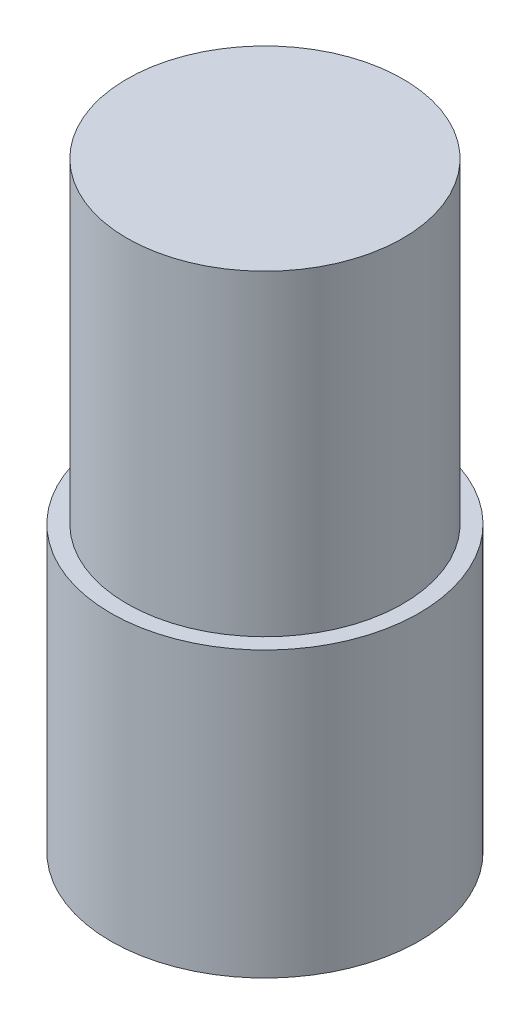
ISO-10303-21;
HEADER;
FILE_DESCRIPTION(('STEP AP214'),'2;1');
FILE_NAME('part.step','',(''),(''),'','','');
FILE_SCHEMA(('AUTOMOTIVE_DESIGN { 1 0 10303 214 1 1 1 1 }'));
ENDSEC;
DATA;
#1=APPLICATION_CONTEXT('core data for automotive mechanical design processes');
#2=APPLICATION_PROTOCOL_DEFINITION('international standard','automotive_design',2000,#1);
#3=PRODUCT_CONTEXT('',#1,'mechanical');
#4=PRODUCT('Part','Part','',(#3));
#5=PRODUCT_RELATED_PRODUCT_CATEGORY('part','',(#4));
#6=PRODUCT_DEFINITION_FORMATION('','',#4);
#7=PRODUCT_DEFINITION_CONTEXT('part definition',#1,'design');
#8=PRODUCT_DEFINITION('design','',#6,#7);
#9=PRODUCT_DEFINITION_SHAPE('','',#8);
#10=(LENGTH_UNIT() NAMED_UNIT(*) SI_UNIT(.MILLI.,.METRE.));
#11=(NAMED_UNIT(*) PLANE_ANGLE_UNIT() SI_UNIT($,.RADIAN.));
#12=(NAMED_UNIT(*) SI_UNIT($,.STERADIAN.) SOLID_ANGLE_UNIT());
#13=UNCERTAINTY_MEASURE_WITH_UNIT(LENGTH_MEASURE(1.E-05),#10,'distance_accuracy_value','');
#14=(GEOMETRIC_REPRESENTATION_CONTEXT(3) GLOBAL_UNCERTAINTY_ASSIGNED_CONTEXT((#13)) GLOBAL_UNIT_ASSIGNED_CONTEXT((#10,
#11,#12)) REPRESENTATION_CONTEXT('',''));
#15=CARTESIAN_POINT('',(0.,0.,0.));
#16=DIRECTION('',(0.,0.,1.));
#17=DIRECTION('',(1.,0.,0.));
#18=AXIS2_PLACEMENT_3D('',#15,#16,#17);
#19=CARTESIAN_POINT('',(0.,35.,0.));
#20=DIRECTION('',(0.,-1.,0.));
#21=DIRECTION('',(0.,0.,-1.));
#22=AXIS2_PLACEMENT_3D('',#19,#20,#21);
#23=CYLINDRICAL_SURFACE('',#22,19.);
#24=CARTESIAN_POINT('',(0.,35.,0.));
#25=DIRECTION('',(0.,1.,0.));
#26=DIRECTION('',(0.,0.,1.));
#27=AXIS2_PLACEMENT_3D('',#24,#25,#26);
#28=CIRCLE('',#27,19.);
#29=CARTESIAN_POINT('',(0.,35.,19.));
#30=VERTEX_POINT('',#29);
#31=EDGE_CURVE('E61',#30,#30,#28,.T.);
#32=ORIENTED_EDGE('',*,*,#31,.F.);
#33=EDGE_LOOP('',(#32));
#34=FACE_BOUND('',#33,.T.);
#35=CARTESIAN_POINT('',(0.,0.,0.));
#36=DIRECTION('',(0.,1.,0.));
#37=DIRECTION('',(0.,0.,1.));
#38=AXIS2_PLACEMENT_3D('',#35,#36,#37);
#39=CIRCLE('',#38,19.);
#40=CARTESIAN_POINT('',(0.,0.,19.));
#41=VERTEX_POINT('',#40);
#42=EDGE_CURVE('E58',#41,#41,#39,.T.);
#43=ORIENTED_EDGE('',*,*,#42,.T.);
#44=EDGE_LOOP('',(#43));
#45=FACE_BOUND('',#44,.T.);
#46=ADVANCED_FACE('F37',(#34,#45),#23,.T.);
#47=CARTESIAN_POINT('',(0.,35.,0.));
#48=DIRECTION('',(0.,1.,0.));
#49=DIRECTION('',(0.,0.,1.));
#50=AXIS2_PLACEMENT_3D('',#47,#48,#49);
#51=PLANE('',#50);
#52=CARTESIAN_POINT('',(0.,35.,0.));
#53=DIRECTION('',(0.,1.,0.));
#54=DIRECTION('',(0.,0.,1.));
#55=AXIS2_PLACEMENT_3D('',#52,#53,#54);
#56=CIRCLE('',#55,17.);
#57=CARTESIAN_POINT('',(0.,35.,17.));
#58=VERTEX_POINT('',#57);
#59=EDGE_CURVE('E48',#58,#58,#56,.T.);
#60=ORIENTED_EDGE('',*,*,#59,.F.);
#61=EDGE_LOOP('',(#60));
#62=FACE_BOUND('',#61,.T.);
#63=ORIENTED_EDGE('',*,*,#31,.T.);
#64=EDGE_LOOP('',(#63));
#65=FACE_BOUND('',#64,.T.);
#66=ADVANCED_FACE('F70',(#62,#65),#51,.T.);
#67=CARTESIAN_POINT('',(0.,0.,0.));
#68=DIRECTION('',(0.,1.,0.));
#69=DIRECTION('',(0.,0.,1.));
#70=AXIS2_PLACEMENT_3D('',#67,#68,#69);
#71=PLANE('',#70);
#72=CARTESIAN_POINT('',(0.,0.,0.));
#73=DIRECTION('',(0.,-1.,0.));
#74=DIRECTION('',(0.,0.,-1.));
#75=AXIS2_PLACEMENT_3D('',#72,#73,#74);
#76=CIRCLE('',#75,3.);
#77=CARTESIAN_POINT('',(0.,0.,-3.));
#78=VERTEX_POINT('',#77);
#79=EDGE_CURVE('E10',#78,#78,#76,.T.);
#80=ORIENTED_EDGE('',*,*,#79,.F.);
#81=EDGE_LOOP('',(#80));
#82=FACE_BOUND('',#81,.T.);
#83=CARTESIAN_POINT('',(-12.,0.,0.));
#84=DIRECTION('',(0.,1.,0.));
#85=DIRECTION('',(0.,0.,1.));
#86=AXIS2_PLACEMENT_3D('',#83,#84,#85);
#87=CIRCLE('',#86,3.);
#88=CARTESIAN_POINT('',(-12.,0.,3.));
#89=VERTEX_POINT('',#88);
#90=EDGE_CURVE('E40',#89,#89,#87,.F.);
#91=ORIENTED_EDGE('',*,*,#90,.F.);
#92=EDGE_LOOP('',(#91));
#93=FACE_BOUND('',#92,.T.);
#94=ORIENTED_EDGE('',*,*,#42,.F.);
#95=EDGE_LOOP('',(#94));
#96=FACE_BOUND('',#95,.T.);
#97=ADVANCED_FACE('F67',(#82,#93,#96),#71,.F.);
#98=CARTESIAN_POINT('',(0.,74.,0.));
#99=DIRECTION('',(0.,-1.,0.));
#100=DIRECTION('',(0.,0.,-1.));
#101=AXIS2_PLACEMENT_3D('',#98,#99,#100);
#102=CYLINDRICAL_SURFACE('',#101,17.);
#103=CARTESIAN_POINT('',(0.,74.,0.));
#104=DIRECTION('',(0.,1.,0.));
#105=DIRECTION('',(0.,0.,1.));
#106=AXIS2_PLACEMENT_3D('',#103,#104,#105);
#107=CIRCLE('',#106,17.);
#108=CARTESIAN_POINT('',(0.,74.,17.));
#109=VERTEX_POINT('',#108);
#110=EDGE_CURVE('E55',#109,#109,#107,.T.);
#111=ORIENTED_EDGE('',*,*,#110,.F.);
#112=EDGE_LOOP('',(#111));
#113=FACE_BOUND('',#112,.T.);
#114=ORIENTED_EDGE('',*,*,#59,.T.);
#115=EDGE_LOOP('',(#114));
#116=FACE_BOUND('',#115,.T.);
#117=ADVANCED_FACE('F69',(#113,#116),#102,.T.);
#118=CARTESIAN_POINT('',(0.,74.,0.));
#119=DIRECTION('',(0.,1.,0.));
#120=DIRECTION('',(0.,0.,1.));
#121=AXIS2_PLACEMENT_3D('',#118,#119,#120);
#122=PLANE('',#121);
#123=ORIENTED_EDGE('',*,*,#110,.T.);
#124=EDGE_LOOP('',(#123));
#125=FACE_BOUND('',#124,.T.);
#126=ADVANCED_FACE('F77',(#125),#122,.T.);
#127=CARTESIAN_POINT('',(-12.,-10.,0.));
#128=DIRECTION('',(0.,1.,0.));
#129=DIRECTION('',(0.,0.,1.));
#130=AXIS2_PLACEMENT_3D('',#127,#128,#129);
#131=CYLINDRICAL_SURFACE('',#130,3.);
#132=CARTESIAN_POINT('',(-12.,-10.,0.));
#133=DIRECTION('',(0.,-1.,0.));
#134=DIRECTION('',(0.,0.,-1.));
#135=AXIS2_PLACEMENT_3D('',#132,#133,#134);
#136=CIRCLE('',#135,3.);
#137=CARTESIAN_POINT('',(-12.,-10.,-3.));
#138=VERTEX_POINT('',#137);
#139=EDGE_CURVE('E52',#138,#138,#136,.T.);
#140=ORIENTED_EDGE('',*,*,#139,.F.);
#141=EDGE_LOOP('',(#140));
#142=FACE_BOUND('',#141,.T.);
#143=ORIENTED_EDGE('',*,*,#90,.T.);
#144=EDGE_LOOP('',(#143));
#145=FACE_BOUND('',#144,.T.);
#146=ADVANCED_FACE('F105',(#142,#145),#131,.T.);
#147=CARTESIAN_POINT('',(-12.,-10.,0.));
#148=DIRECTION('',(0.,-1.,0.));
#149=DIRECTION('',(0.,0.,-1.));
#150=AXIS2_PLACEMENT_3D('',#147,#148,#149);
#151=PLANE('',#150);
#152=ORIENTED_EDGE('',*,*,#139,.T.);
#153=EDGE_LOOP('',(#152));
#154=FACE_BOUND('',#153,.T.);
#155=ADVANCED_FACE('F117',(#154),#151,.T.);
#156=CARTESIAN_POINT('',(0.,-10.,0.));
#157=DIRECTION('',(0.,1.,0.));
#158=DIRECTION('',(0.,0.,1.));
#159=AXIS2_PLACEMENT_3D('',#156,#157,#158);
#160=CYLINDRICAL_SURFACE('',#159,3.);
#161=CARTESIAN_POINT('',(0.,-10.,0.));
#162=DIRECTION('',(0.,-1.,0.));
#163=DIRECTION('',(0.,0.,-1.));
#164=AXIS2_PLACEMENT_3D('',#161,#162,#163);
#165=CIRCLE('',#164,3.);
#166=CARTESIAN_POINT('',(0.,-10.,-3.));
#167=VERTEX_POINT('',#166);
#168=EDGE_CURVE('E51',#167,#167,#165,.T.);
#169=ORIENTED_EDGE('',*,*,#168,.F.);
#170=EDGE_LOOP('',(#169));
#171=FACE_BOUND('',#170,.T.);
#172=ORIENTED_EDGE('',*,*,#79,.T.);
#173=EDGE_LOOP('',(#172));
#174=FACE_BOUND('',#173,.T.);
#175=ADVANCED_FACE('F127',(#171,#174),#160,.T.);
#176=CARTESIAN_POINT('',(0.,-10.,0.));
#177=DIRECTION('',(0.,-1.,0.));
#178=DIRECTION('',(0.,0.,-1.));
#179=AXIS2_PLACEMENT_3D('',#176,#177,#178);
#180=PLANE('',#179);
#181=ORIENTED_EDGE('',*,*,#168,.T.);
#182=EDGE_LOOP('',(#181));
#183=FACE_BOUND('',#182,.T.);
#184=ADVANCED_FACE('F137',(#183),#180,.T.);
#185=CLOSED_SHELL('',(#46,#66,#97,#117,#126,#146,#155,#175,#184));
#186=MANIFOLD_SOLID_BREP('B2',#185);
#187=ADVANCED_BREP_SHAPE_REPRESENTATION('',(#18,#186),#14);
#188=SHAPE_DEFINITION_REPRESENTATION(#9,#187);
ENDSEC;
END-ISO-10303-21;
